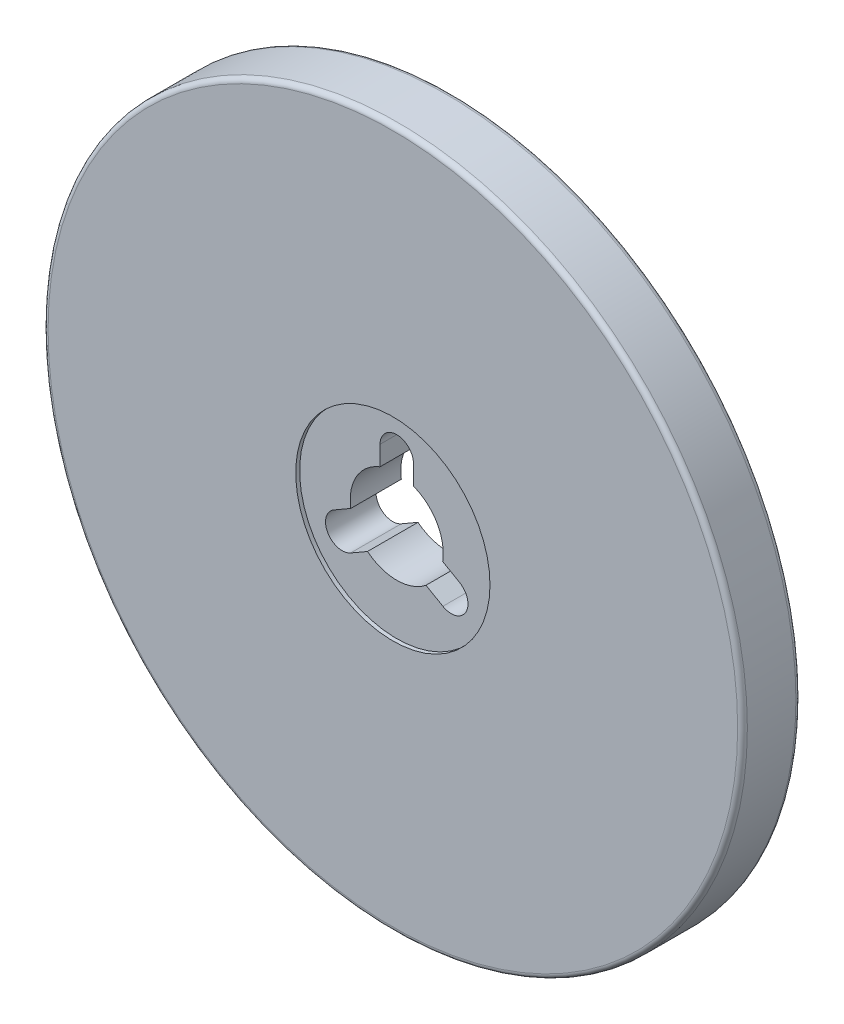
from build123d import *

# Parameters (mm, degrees)
SKETCH1_R          = 228.6
EXTRUDE1_DEPTH     = 19.05
SKETCH2_R          = 30.4165
CUT_EXTRUDE1_DEPTH = 326.526542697
CUT_EXTRUDE2_DEPTH = 326.526542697
CIRPATTERN1_COUNT  = 3
FILLET1_R          = 3.175
FILLET2_R          = 3.175
SKETCH4_R          = 63.5
CUT_EXTRUDE3_DEPTH = 2.54


with BuildPart() as part:
    # Sketch1 → Extrude1 (new, symmetric)
    with BuildSketch(Plane.XY):
        with Locations(Location((0, 0, 0), (0, 0, 180))):
            Circle(SKETCH1_R)
    extrude(amount=EXTRUDE1_DEPTH, both=True)

    # Sketch2 → Cut-Extrude1 (cut, through all)
    with BuildSketch(Plane.XY.offset(19.05)):
        Circle(SKETCH2_R)
    extrude(amount=-CUT_EXTRUDE1_DEPTH, mode=Mode.SUBTRACT)

    # Sketch3 → Cut-Extrude2 (cut, symmetric)
    with BuildSketch(Plane.XY.offset(19.05)):
        with BuildLine():
            Line((10.922, 28.387909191), (10.922, 41.148))
            ThreePointArc((10.922, 41.148), (0, 52.07), (-10.922, 41.148))
            Line((-10.922, 41.148), (-10.922, 28.387909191))
            ThreePointArc((-10.922, 28.387909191), (0, 30.4165), (10.922, 28.387909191))
        make_face()
    cut_extrude2 = extrude(amount=CUT_EXTRUDE2_DEPTH, both=True, mode=Mode.SUBTRACT)

    # CirPattern1: Cut-Extrude2 ×3 about axis
    cirpattern1_axis = Axis((0, 0, -19.05), (0, 0, 1))
    for i in range(1, CIRPATTERN1_COUNT):
        add(cut_extrude2.rotate(cirpattern1_axis, i * 360 / CIRPATTERN1_COUNT), mode=Mode.SUBTRACT)

    # Fillet1
    fillet1_edges = [part.edges().sort_by_distance(p)[0] for p in [
        (228.6, 0, 19.05),
    ]]
    fillet(fillet1_edges, radius=FILLET1_R)

    # Fillet2
    fillet2_edges = [part.edges().sort_by_distance(p)[0] for p in [
        (228.6, 0, -19.05),
    ]]
    fillet(fillet2_edges, radius=FILLET2_R)

    # Sketch4 → Cut-Extrude3 (cut)
    with BuildSketch(Plane.XY.offset(19.05)):
        Circle(SKETCH4_R)
    cut_extrude3 = extrude(amount=-CUT_EXTRUDE3_DEPTH, mode=Mode.SUBTRACT)

    # Mirror1: Cut-Extrude3 across plane
    add(cut_extrude3.mirror(Plane.XY), mode=Mode.SUBTRACT)


solid = part.part
